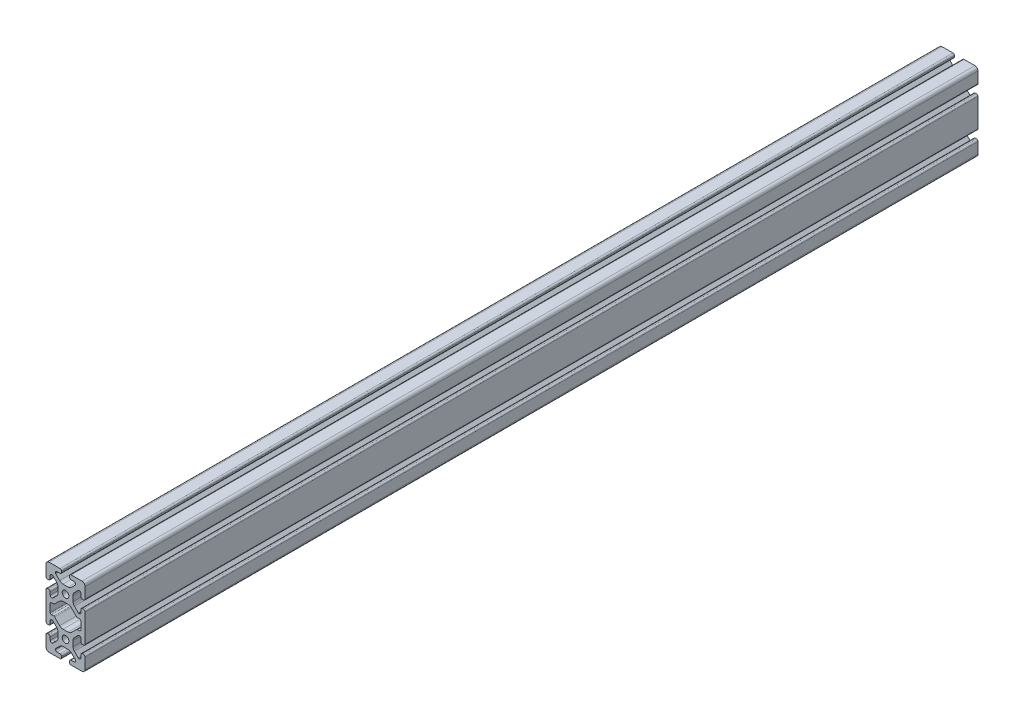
from build123d import *

# Parameters (mm, degrees)
SKETCH1_R           = 3.405
BOSS_EXTRUDE1_DEPTH = 3048
SKETCH26_W          = 40
SKETCH26_H          = 80.80011746
CUT_1_3FT_DEPTH     = 2135.537177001


with BuildPart() as part:
    # Sketch1 → Boss-Extrude1 (new body)
    with BuildSketch(Plane(origin=(0, 0, -3048), x_dir=(-1, 0, 0), z_dir=(0, 0, -1))):
        with BuildLine():
            Line((16.83, 60), (5.69044933, 60))
            ThreePointArc((5.69044933, 60), (4.580291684, 59.540157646), (4.12044933, 58.43))
            Line((4.12044933, 58.43), (4.12044933, 57.25))
            ThreePointArc((4.12044933, 57.25), (4.580291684, 56.139842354), (5.69044933, 55.68))
            Line((5.69044933, 55.68), (8.7153995, 55.68))
            ThreePointArc((8.7153995, 55.68), (9.825557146, 55.220157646), (10.2853995, 54.11))
            Line((10.2853995, 54.11), (10.2853995, 53.654903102))
            ThreePointArc((10.2853995, 53.654903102), (10.227547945, 53.364063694), (10.062800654, 53.117501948))
            Line((10.062800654, 53.117501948), (6.055092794, 49.109794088))
            ThreePointArc((6.055092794, 49.109794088), (4.47691877, 48.055291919), (2.615335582, 47.685))
            Line((2.615335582, 47.685), (-2.615335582, 47.685))
            ThreePointArc((-2.615335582, 47.685), (-4.47691877, 48.055291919), (-6.055092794, 49.109794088))
            Line((-6.055092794, 49.109794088), (-10.062800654, 53.117501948))
            ThreePointArc((-10.062800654, 53.117501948), (-10.227547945, 53.364063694), (-10.2853995, 53.654903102))
            Line((-10.2853995, 53.654903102), (-10.2853995, 54.11))
            ThreePointArc((-10.2853995, 54.11), (-9.825557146, 55.220157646), (-8.7153995, 55.68))
            Line((-8.7153995, 55.68), (-5.69044933, 55.68))
            ThreePointArc((-5.69044933, 55.68), (-4.580291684, 56.139842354), (-4.12044933, 57.25))
            Line((-4.12044933, 57.25), (-4.12044933, 58.43))
            ThreePointArc((-4.12044933, 58.43), (-4.580291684, 59.540157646), (-5.69044933, 60))
            Line((-5.69044933, 60), (-16.83, 60))
            ThreePointArc((-16.83, 60), (-19.071528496, 59.071528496), (-20, 56.83))
            Line((-20, 56.83), (-20, 45.69044933))
            ThreePointArc((-20, 45.69044933), (-19.540157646, 44.580291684), (-18.43, 44.12044933))
            Line((-18.43, 44.12044933), (-17.25, 44.12044933))
            ThreePointArc((-17.25, 44.12044933), (-16.139842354, 44.580291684), (-15.68, 45.69044933))
            Line((-15.68, 45.69044933), (-15.68, 48.7153995))
            ThreePointArc((-15.68, 48.7153995), (-15.220157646, 49.825557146), (-14.11, 50.2853995))
            Line((-14.11, 50.2853995), (-13.652670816, 50.2853995))
            ThreePointArc((-13.652670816, 50.2853995), (-13.361831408, 50.227547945), (-13.115269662, 50.062800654))
            Line((-13.115269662, 50.062800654), (-9.109794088, 46.05732508))
            ThreePointArc((-9.109794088, 46.05732508), (-8.055291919, 44.479151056), (-7.685, 42.617567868))
            Line((-7.685, 42.617567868), (-7.685, 37.384664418))
            ThreePointArc((-7.685, 37.384664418), (-8.055291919, 35.52308123), (-9.109794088, 33.944907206))
            Line((-9.109794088, 33.944907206), (-13.117501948, 29.937199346))
            ThreePointArc((-13.117501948, 29.937199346), (-13.364063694, 29.772452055), (-13.654903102, 29.7146005))
            Line((-13.654903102, 29.7146005), (-14.11, 29.7146005))
            ThreePointArc((-14.11, 29.7146005), (-15.220157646, 30.174442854), (-15.68, 31.2846005))
            Line((-15.68, 31.2846005), (-15.68, 34.30955067))
            ThreePointArc((-15.68, 34.30955067), (-16.139842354, 35.419708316), (-17.25, 35.87955067))
            Line((-17.25, 35.87955067), (-18.43, 35.87955067))
            ThreePointArc((-18.43, 35.87955067), (-19.540157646, 35.419708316), (-20, 34.30955067))
            Line((-20, 34.30955067), (-20, 5.69044933))
            ThreePointArc((-20, 5.69044933), (-19.540157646, 4.580291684), (-18.43, 4.12044933))
            Line((-18.43, 4.12044933), (-17.25, 4.12044933))
            ThreePointArc((-17.25, 4.12044933), (-16.139842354, 4.580291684), (-15.68, 5.69044933))
            Line((-15.68, 5.69044933), (-15.68, 8.7153995))
            ThreePointArc((-15.68, 8.7153995), (-15.220157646, 9.825557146), (-14.11, 10.2853995))
            Line((-14.11, 10.2853995), (-13.654903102, 10.2853995))
            ThreePointArc((-13.654903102, 10.2853995), (-13.364063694, 10.227547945), (-13.117501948, 10.062800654))
            Line((-13.117501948, 10.062800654), (-9.109794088, 6.055092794))
            ThreePointArc((-9.109794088, 6.055092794), (-8.055291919, 4.47691877), (-7.685, 2.615335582))
            Line((-7.685, 2.615335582), (-7.685, -2.615335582))
            ThreePointArc((-7.685, -2.615335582), (-8.055291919, -4.47691877), (-9.109794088, -6.055092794))
            Line((-9.109794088, -6.055092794), (-13.117501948, -10.062800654))
            ThreePointArc((-13.117501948, -10.062800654), (-13.364063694, -10.227547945), (-13.654903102, -10.2853995))
            Line((-13.654903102, -10.2853995), (-14.11, -10.2853995))
            ThreePointArc((-14.11, -10.2853995), (-15.220157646, -9.825557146), (-15.68, -8.7153995))
            Line((-15.68, -8.7153995), (-15.68, -5.69044933))
            ThreePointArc((-15.68, -5.69044933), (-16.139842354, -4.580291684), (-17.25, -4.12044933))
            Line((-17.25, -4.12044933), (-18.43, -4.12044933))
            ThreePointArc((-18.43, -4.12044933), (-19.540157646, -4.580291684), (-20, -5.69044933))
            Line((-20, -5.69044933), (-20, -16.83))
            ThreePointArc((-20, -16.83), (-19.071528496, -19.071528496), (-16.83, -20))
            Line((-16.83, -20), (-5.69044933, -20))
            ThreePointArc((-5.69044933, -20), (-4.580291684, -19.540157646), (-4.12044933, -18.43))
            Line((-4.12044933, -18.43), (-4.12044933, -17.25))
            ThreePointArc((-4.12044933, -17.25), (-4.580291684, -16.139842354), (-5.69044933, -15.68))
            Line((-5.69044933, -15.68), (-8.7153995, -15.68))
            ThreePointArc((-8.7153995, -15.68), (-9.825557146, -15.220157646), (-10.2853995, -14.11))
            Line((-10.2853995, -14.11), (-10.2853995, -13.654903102))
            ThreePointArc((-10.2853995, -13.654903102), (-10.227547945, -13.364063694), (-10.062800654, -13.117501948))
            Line((-10.062800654, -13.117501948), (-6.055092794, -9.109794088))
            ThreePointArc((-6.055092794, -9.109794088), (-4.47691877, -8.055291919), (-2.615335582, -7.685))
            Line((-2.615335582, -7.685), (2.615335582, -7.685))
            ThreePointArc((2.615335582, -7.685), (4.47691877, -8.055291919), (6.055092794, -9.109794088))
            Line((6.055092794, -9.109794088), (10.062800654, -13.117501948))
            ThreePointArc((10.062800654, -13.117501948), (10.227547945, -13.364063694), (10.2853995, -13.654903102))
            Line((10.2853995, -13.654903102), (10.2853995, -14.11))
            ThreePointArc((10.2853995, -14.11), (9.825557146, -15.220157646), (8.7153995, -15.68))
            Line((8.7153995, -15.68), (5.69044933, -15.68))
            ThreePointArc((5.69044933, -15.68), (4.580291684, -16.139842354), (4.12044933, -17.25))
            Line((4.12044933, -17.25), (4.12044933, -18.43))
            ThreePointArc((4.12044933, -18.43), (4.580291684, -19.540157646), (5.69044933, -20))
            Line((5.69044933, -20), (16.83, -20))
            ThreePointArc((16.83, -20), (19.071528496, -19.071528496), (20, -16.83))
            Line((20, -16.83), (20, -5.69044933))
            ThreePointArc((20, -5.69044933), (19.540157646, -4.580291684), (18.43, -4.12044933))
            Line((18.43, -4.12044933), (17.25, -4.12044933))
            ThreePointArc((17.25, -4.12044933), (16.139842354, -4.580291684), (15.68, -5.69044933))
            Line((15.68, -5.69044933), (15.68, -8.7153995))
            ThreePointArc((15.68, -8.7153995), (15.220157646, -9.825557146), (14.11, -10.2853995))
            Line((14.11, -10.2853995), (13.654903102, -10.2853995))
            ThreePointArc((13.654903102, -10.2853995), (13.364063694, -10.227547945), (13.117501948, -10.062800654))
            Line((13.117501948, -10.062800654), (9.109794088, -6.055092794))
            ThreePointArc((9.109794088, -6.055092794), (8.055291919, -4.47691877), (7.685, -2.615335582))
            Line((7.685, -2.615335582), (7.685, 2.615335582))
            ThreePointArc((7.685, 2.615335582), (8.055291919, 4.47691877), (9.109794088, 6.055092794))
            Line((9.109794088, 6.055092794), (13.117501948, 10.062800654))
            ThreePointArc((13.117501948, 10.062800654), (13.364063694, 10.227547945), (13.654903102, 10.2853995))
            Line((13.654903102, 10.2853995), (14.11, 10.2853995))
            ThreePointArc((14.11, 10.2853995), (15.220157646, 9.825557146), (15.68, 8.7153995))
            Line((15.68, 8.7153995), (15.68, 5.69044933))
            ThreePointArc((15.68, 5.69044933), (16.139842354, 4.580291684), (17.25, 4.12044933))
            Line((17.25, 4.12044933), (18.43, 4.12044933))
            ThreePointArc((18.43, 4.12044933), (19.540157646, 4.580291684), (20, 5.69044933))
            Line((20, 5.69044933), (20, 34.30955067))
            ThreePointArc((20, 34.30955067), (19.540157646, 35.419708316), (18.43, 35.87955067))
            Line((18.43, 35.87955067), (17.25, 35.87955067))
            ThreePointArc((17.25, 35.87955067), (16.139842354, 35.419708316), (15.68, 34.30955067))
            Line((15.68, 34.30955067), (15.68, 31.2846005))
            ThreePointArc((15.68, 31.2846005), (15.220157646, 30.174442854), (14.11, 29.7146005))
            Line((14.11, 29.7146005), (13.654903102, 29.7146005))
            ThreePointArc((13.654903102, 29.7146005), (13.364063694, 29.772452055), (13.117501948, 29.937199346))
            Line((13.117501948, 29.937199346), (9.109794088, 33.944907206))
            ThreePointArc((9.109794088, 33.944907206), (8.055291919, 35.52308123), (7.685, 37.384664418))
            Line((7.685, 37.384664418), (7.685, 42.615335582))
            ThreePointArc((7.685, 42.615335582), (8.055291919, 44.47691877), (9.109794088, 46.055092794))
            Line((9.109794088, 46.055092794), (13.117501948, 50.062800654))
            ThreePointArc((13.117501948, 50.062800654), (13.364063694, 50.227547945), (13.654903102, 50.2853995))
            Line((13.654903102, 50.2853995), (14.11, 50.2853995))
            ThreePointArc((14.11, 50.2853995), (15.220157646, 49.825557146), (15.68, 48.7153995))
            Line((15.68, 48.7153995), (15.68, 45.69044933))
            ThreePointArc((15.68, 45.69044933), (16.139842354, 44.580291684), (17.25, 44.12044933))
            Line((17.25, 44.12044933), (18.43, 44.12044933))
            ThreePointArc((18.43, 44.12044933), (19.540157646, 44.580291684), (20, 45.69044933))
            Line((20, 45.69044933), (20, 56.83))
            ThreePointArc((20, 56.83), (19.071528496, 59.071528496), (16.83, 60))
        make_face()
        with Locations(Location((0, 0, 0), (0, 0, 180))):
            Circle(SKETCH1_R, mode=Mode.SUBTRACT)
        with Locations(Location((0, 40, 0), (0, 0, 180))):
            Circle(SKETCH1_R, mode=Mode.SUBTRACT)
        with BuildLine():
            Line((14.41, 14.65864833), (12.129998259, 14.65864833))
            ThreePointArc((12.129998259, 14.65864833), (11.608780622, 14.546764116), (11.179399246, 14.230824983))
            Line((11.179399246, 14.230824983), (6.055092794, 9.109794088))
            ThreePointArc((6.055092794, 9.109794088), (4.47691877, 8.055291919), (2.615335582, 7.685))
            Line((2.615335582, 7.685), (-2.615335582, 7.685))
            ThreePointArc((-2.615335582, 7.685), (-4.47691877, 8.055291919), (-6.055092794, 9.109794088))
            Line((-6.055092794, 9.109794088), (-11.231972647, 14.286673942))
            ThreePointArc((-11.231972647, 14.286673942), (-11.6439903, 14.561975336), (-12.129998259, 14.65864833))
            Line((-12.129998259, 14.65864833), (-14.41, 14.65864833))
            ThreePointArc((-14.41, 14.65864833), (-15.308025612, 15.030622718), (-15.68, 15.92864833))
            Line((-15.68, 15.92864833), (-15.68, 24.07135167))
            ThreePointArc((-15.68, 24.07135167), (-15.308025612, 24.969377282), (-14.41, 25.34135167))
            Line((-14.41, 25.34135167), (-12.129998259, 25.34135167))
            ThreePointArc((-12.129998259, 25.34135167), (-11.6439903, 25.438024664), (-11.231972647, 25.713326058))
            Line((-11.231972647, 25.713326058), (-6.055092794, 30.890205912))
            ThreePointArc((-6.055092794, 30.890205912), (-4.47691877, 31.944708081), (-2.615335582, 32.315))
            Line((-2.615335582, 32.315), (2.617567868, 32.315))
            ThreePointArc((2.617567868, 32.315), (4.479151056, 31.944708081), (6.05732508, 30.890205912))
            Line((6.05732508, 30.890205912), (11.184160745, 25.763370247))
            ThreePointArc((11.184160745, 25.763370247), (11.612140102, 25.451641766), (12.129998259, 25.34135167))
            Line((12.129998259, 25.34135167), (14.41, 25.34135167))
            ThreePointArc((14.41, 25.34135167), (15.308025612, 24.969377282), (15.68, 24.07135167))
            Line((15.68, 24.07135167), (15.68, 15.92864833))
            ThreePointArc((15.68, 15.92864833), (15.308025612, 15.030622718), (14.41, 14.65864833))
        make_face(mode=Mode.SUBTRACT)
    extrude(amount=-BOSS_EXTRUDE1_DEPTH)

    # Sketch26 → Cut 1 - 3ft (cut, through all)
    with BuildSketch(Plane.XY.offset(-914.4)):
        with Locations((0, 19.59994127)):
            Rectangle(SKETCH26_W, SKETCH26_H)
    extrude(amount=-CUT_1_3FT_DEPTH, mode=Mode.SUBTRACT)


solid = part.part
